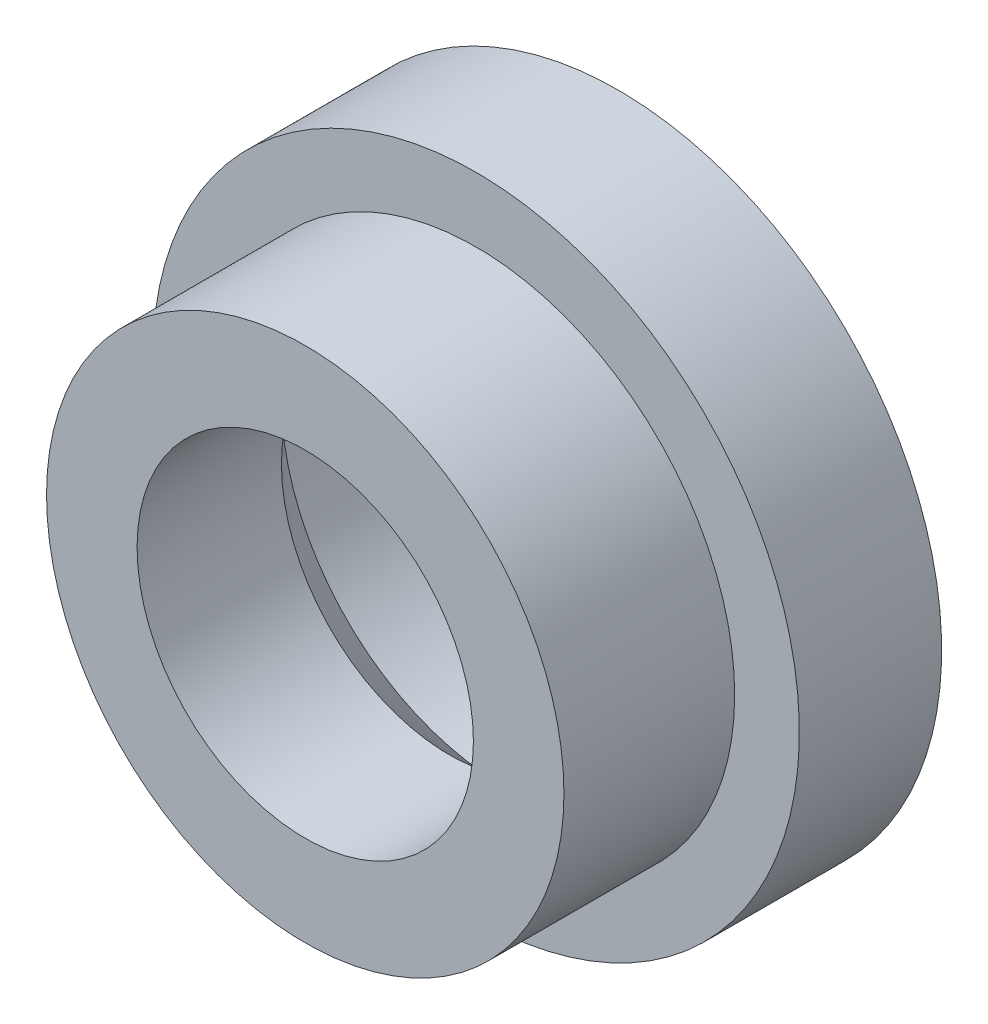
ISO-10303-21;
HEADER;
FILE_DESCRIPTION(('STEP AP214'),'2;1');
FILE_NAME('part.step','',(''),(''),'','','');
FILE_SCHEMA(('AUTOMOTIVE_DESIGN { 1 0 10303 214 1 1 1 1 }'));
ENDSEC;
DATA;
#1=APPLICATION_CONTEXT('core data for automotive mechanical design processes');
#2=APPLICATION_PROTOCOL_DEFINITION('international standard','automotive_design',2000,#1);
#3=PRODUCT_CONTEXT('',#1,'mechanical');
#4=PRODUCT('Part','Part','',(#3));
#5=PRODUCT_RELATED_PRODUCT_CATEGORY('part','',(#4));
#6=PRODUCT_DEFINITION_FORMATION('','',#4);
#7=PRODUCT_DEFINITION_CONTEXT('part definition',#1,'design');
#8=PRODUCT_DEFINITION('design','',#6,#7);
#9=PRODUCT_DEFINITION_SHAPE('','',#8);
#10=(LENGTH_UNIT() NAMED_UNIT(*) SI_UNIT(.MILLI.,.METRE.));
#11=(NAMED_UNIT(*) PLANE_ANGLE_UNIT() SI_UNIT($,.RADIAN.));
#12=(NAMED_UNIT(*) SI_UNIT($,.STERADIAN.) SOLID_ANGLE_UNIT());
#13=UNCERTAINTY_MEASURE_WITH_UNIT(LENGTH_MEASURE(1.E-05),#10,'distance_accuracy_value','');
#14=(GEOMETRIC_REPRESENTATION_CONTEXT(3) GLOBAL_UNCERTAINTY_ASSIGNED_CONTEXT((#13)) GLOBAL_UNIT_ASSIGNED_CONTEXT((#10,
#11,#12)) REPRESENTATION_CONTEXT('',''));
#15=CARTESIAN_POINT('',(0.,0.,0.));
#16=DIRECTION('',(0.,0.,1.));
#17=DIRECTION('',(1.,0.,0.));
#18=AXIS2_PLACEMENT_3D('',#15,#16,#17);
#19=CARTESIAN_POINT('',(0.,0.,0.));
#20=DIRECTION('',(0.,0.,-1.));
#21=DIRECTION('',(-1.,0.,0.));
#22=AXIS2_PLACEMENT_3D('',#19,#20,#21);
#23=CYLINDRICAL_SURFACE('',#22,12.5);
#24=CARTESIAN_POINT('',(0.,0.,5.5));
#25=DIRECTION('',(0.,0.,-1.));
#26=DIRECTION('',(-1.,0.,0.));
#27=AXIS2_PLACEMENT_3D('',#24,#25,#26);
#28=CIRCLE('',#27,12.5);
#29=CARTESIAN_POINT('',(-12.5,0.,5.5));
#30=VERTEX_POINT('',#29);
#31=EDGE_CURVE('E8',#30,#30,#28,.T.);
#32=ORIENTED_EDGE('',*,*,#31,.T.);
#33=EDGE_LOOP('',(#32));
#34=FACE_BOUND('',#33,.T.);
#35=CARTESIAN_POINT('',(0.,0.,0.));
#36=DIRECTION('',(0.,0.,-1.));
#37=DIRECTION('',(-1.,0.,0.));
#38=AXIS2_PLACEMENT_3D('',#35,#36,#37);
#39=CIRCLE('',#38,12.5);
#40=CARTESIAN_POINT('',(-12.5,0.,0.));
#41=VERTEX_POINT('',#40);
#42=EDGE_CURVE('E40',#41,#41,#39,.T.);
#43=ORIENTED_EDGE('',*,*,#42,.F.);
#44=EDGE_LOOP('',(#43));
#45=FACE_BOUND('',#44,.T.);
#46=ADVANCED_FACE('F12',(#34,#45),#23,.T.);
#47=CARTESIAN_POINT('',(0.,12.5,5.5));
#48=DIRECTION('',(0.,0.,1.));
#49=DIRECTION('',(1.,0.,0.));
#50=AXIS2_PLACEMENT_3D('',#47,#48,#49);
#51=PLANE('',#50);
#52=CARTESIAN_POINT('',(0.,0.,5.5));
#53=DIRECTION('',(0.,0.,-1.));
#54=DIRECTION('',(-1.,0.,0.));
#55=AXIS2_PLACEMENT_3D('',#52,#53,#54);
#56=CIRCLE('',#55,10.);
#57=CARTESIAN_POINT('',(-10.,0.,5.5));
#58=VERTEX_POINT('',#57);
#59=EDGE_CURVE('E18',#58,#58,#56,.T.);
#60=ORIENTED_EDGE('',*,*,#59,.T.);
#61=EDGE_LOOP('',(#60));
#62=FACE_BOUND('',#61,.T.);
#63=ORIENTED_EDGE('',*,*,#31,.F.);
#64=EDGE_LOOP('',(#63));
#65=FACE_BOUND('',#64,.T.);
#66=ADVANCED_FACE('F48',(#62,#65),#51,.T.);
#67=CARTESIAN_POINT('',(0.,0.,0.));
#68=DIRECTION('',(0.,0.,-1.));
#69=DIRECTION('',(-1.,0.,0.));
#70=AXIS2_PLACEMENT_3D('',#67,#68,#69);
#71=CYLINDRICAL_SURFACE('',#70,10.);
#72=CARTESIAN_POINT('',(0.,0.,12.1));
#73=DIRECTION('',(0.,0.,-1.));
#74=DIRECTION('',(-1.,0.,0.));
#75=AXIS2_PLACEMENT_3D('',#72,#73,#74);
#76=CIRCLE('',#75,10.);
#77=CARTESIAN_POINT('',(-10.,0.,12.1));
#78=VERTEX_POINT('',#77);
#79=EDGE_CURVE('E22',#78,#78,#76,.T.);
#80=ORIENTED_EDGE('',*,*,#79,.T.);
#81=EDGE_LOOP('',(#80));
#82=FACE_BOUND('',#81,.T.);
#83=ORIENTED_EDGE('',*,*,#59,.F.);
#84=EDGE_LOOP('',(#83));
#85=FACE_BOUND('',#84,.T.);
#86=ADVANCED_FACE('F53',(#82,#85),#71,.T.);
#87=CARTESIAN_POINT('',(0.,10.,12.1));
#88=DIRECTION('',(0.,0.,1.));
#89=DIRECTION('',(1.,0.,0.));
#90=AXIS2_PLACEMENT_3D('',#87,#88,#89);
#91=PLANE('',#90);
#92=CARTESIAN_POINT('',(0.,0.,12.1));
#93=DIRECTION('',(0.,0.,-1.));
#94=DIRECTION('',(-1.,0.,0.));
#95=AXIS2_PLACEMENT_3D('',#92,#93,#94);
#96=CIRCLE('',#95,6.5);
#97=CARTESIAN_POINT('',(-6.5,0.,12.1));
#98=VERTEX_POINT('',#97);
#99=EDGE_CURVE('E26',#98,#98,#96,.T.);
#100=ORIENTED_EDGE('',*,*,#99,.T.);
#101=EDGE_LOOP('',(#100));
#102=FACE_BOUND('',#101,.T.);
#103=ORIENTED_EDGE('',*,*,#79,.F.);
#104=EDGE_LOOP('',(#103));
#105=FACE_BOUND('',#104,.T.);
#106=ADVANCED_FACE('F57',(#102,#105),#91,.T.);
#107=CARTESIAN_POINT('',(0.,0.,0.));
#108=DIRECTION('',(0.,0.,-1.));
#109=DIRECTION('',(-1.,0.,0.));
#110=AXIS2_PLACEMENT_3D('',#107,#108,#109);
#111=CYLINDRICAL_SURFACE('',#110,6.5);
#112=CARTESIAN_POINT('',(0.,0.,6.52));
#113=DIRECTION('',(0.,0.,-1.));
#114=DIRECTION('',(-1.,0.,0.));
#115=AXIS2_PLACEMENT_3D('',#112,#113,#114);
#116=CIRCLE('',#115,6.5);
#117=CARTESIAN_POINT('',(-6.5,0.,6.52));
#118=VERTEX_POINT('',#117);
#119=EDGE_CURVE('E31',#118,#118,#116,.T.);
#120=ORIENTED_EDGE('',*,*,#119,.T.);
#121=EDGE_LOOP('',(#120));
#122=FACE_BOUND('',#121,.T.);
#123=ORIENTED_EDGE('',*,*,#99,.F.);
#124=EDGE_LOOP('',(#123));
#125=FACE_BOUND('',#124,.T.);
#126=ADVANCED_FACE('F64',(#122,#125),#111,.F.);
#127=CARTESIAN_POINT('',(0.,0.,6.52));
#128=DIRECTION('',(0.,0.,-1.));
#129=DIRECTION('',(-1.,0.,0.));
#130=AXIS2_PLACEMENT_3D('',#127,#128,#129);
#131=CONICAL_SURFACE('',#130,6.5,0.785398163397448);
#132=CARTESIAN_POINT('',(0.,0.,4.37));
#133=DIRECTION('',(0.,0.,-1.));
#134=DIRECTION('',(-1.,0.,0.));
#135=AXIS2_PLACEMENT_3D('',#132,#133,#134);
#136=CIRCLE('',#135,8.65);
#137=CARTESIAN_POINT('',(-8.65,0.,4.37));
#138=VERTEX_POINT('',#137);
#139=EDGE_CURVE('E34',#138,#138,#136,.T.);
#140=ORIENTED_EDGE('',*,*,#139,.T.);
#141=EDGE_LOOP('',(#140));
#142=FACE_BOUND('',#141,.T.);
#143=ORIENTED_EDGE('',*,*,#119,.F.);
#144=EDGE_LOOP('',(#143));
#145=FACE_BOUND('',#144,.T.);
#146=ADVANCED_FACE('F68',(#142,#145),#131,.F.);
#147=CARTESIAN_POINT('',(0.,0.,0.));
#148=DIRECTION('',(0.,0.,-1.));
#149=DIRECTION('',(-1.,0.,0.));
#150=AXIS2_PLACEMENT_3D('',#147,#148,#149);
#151=CYLINDRICAL_SURFACE('',#150,8.65);
#152=CARTESIAN_POINT('',(0.,0.,0.));
#153=DIRECTION('',(0.,0.,-1.));
#154=DIRECTION('',(-1.,0.,0.));
#155=AXIS2_PLACEMENT_3D('',#152,#153,#154);
#156=CIRCLE('',#155,8.65);
#157=CARTESIAN_POINT('',(-8.65,0.,0.));
#158=VERTEX_POINT('',#157);
#159=EDGE_CURVE('E37',#158,#158,#156,.T.);
#160=ORIENTED_EDGE('',*,*,#159,.T.);
#161=EDGE_LOOP('',(#160));
#162=FACE_BOUND('',#161,.T.);
#163=ORIENTED_EDGE('',*,*,#139,.F.);
#164=EDGE_LOOP('',(#163));
#165=FACE_BOUND('',#164,.T.);
#166=ADVANCED_FACE('F72',(#162,#165),#151,.F.);
#167=CARTESIAN_POINT('',(0.,8.65,0.));
#168=DIRECTION('',(0.,0.,-1.));
#169=DIRECTION('',(-1.,0.,0.));
#170=AXIS2_PLACEMENT_3D('',#167,#168,#169);
#171=PLANE('',#170);
#172=ORIENTED_EDGE('',*,*,#42,.T.);
#173=EDGE_LOOP('',(#172));
#174=FACE_BOUND('',#173,.T.);
#175=ORIENTED_EDGE('',*,*,#159,.F.);
#176=EDGE_LOOP('',(#175));
#177=FACE_BOUND('',#176,.T.);
#178=ADVANCED_FACE('F44',(#174,#177),#171,.T.);
#179=CLOSED_SHELL('',(#46,#66,#86,#106,#126,#146,#166,#178));
#180=MANIFOLD_SOLID_BREP('B1',#179);
#181=ADVANCED_BREP_SHAPE_REPRESENTATION('',(#18,#180),#14);
#182=SHAPE_DEFINITION_REPRESENTATION(#9,#181);
ENDSEC;
END-ISO-10303-21;
